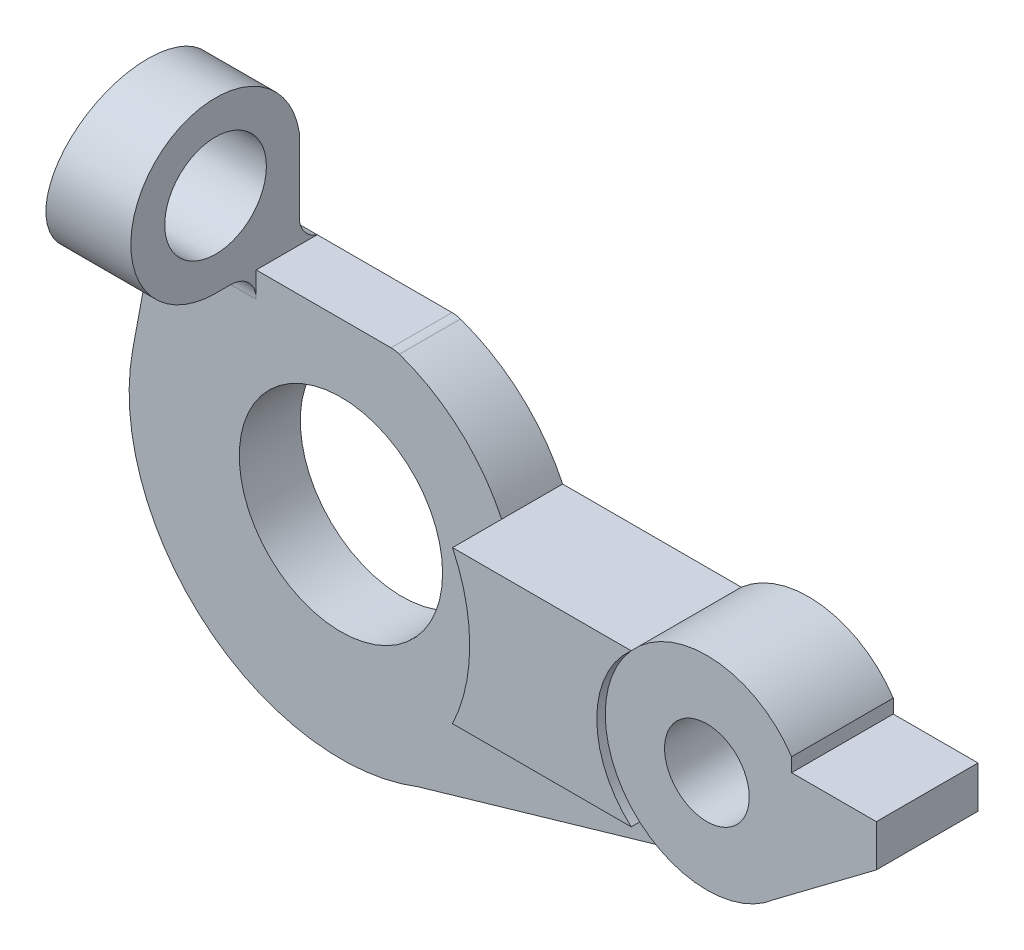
ISO-10303-21;
HEADER;
FILE_DESCRIPTION(('STEP AP214'),'2;1');
FILE_NAME('part.step','',(''),(''),'','','');
FILE_SCHEMA(('AUTOMOTIVE_DESIGN { 1 0 10303 214 1 1 1 1 }'));
ENDSEC;
DATA;
#1=APPLICATION_CONTEXT('core data for automotive mechanical design processes');
#2=APPLICATION_PROTOCOL_DEFINITION('international standard','automotive_design',2000,#1);
#3=PRODUCT_CONTEXT('',#1,'mechanical');
#4=PRODUCT('Part','Part','',(#3));
#5=PRODUCT_RELATED_PRODUCT_CATEGORY('part','',(#4));
#6=PRODUCT_DEFINITION_FORMATION('','',#4);
#7=PRODUCT_DEFINITION_CONTEXT('part definition',#1,'design');
#8=PRODUCT_DEFINITION('design','',#6,#7);
#9=PRODUCT_DEFINITION_SHAPE('','',#8);
#10=(LENGTH_UNIT() NAMED_UNIT(*) SI_UNIT(.MILLI.,.METRE.));
#11=(NAMED_UNIT(*) PLANE_ANGLE_UNIT() SI_UNIT($,.RADIAN.));
#12=(NAMED_UNIT(*) SI_UNIT($,.STERADIAN.) SOLID_ANGLE_UNIT());
#13=UNCERTAINTY_MEASURE_WITH_UNIT(LENGTH_MEASURE(1.E-05),#10,'distance_accuracy_value','');
#14=(GEOMETRIC_REPRESENTATION_CONTEXT(3) GLOBAL_UNCERTAINTY_ASSIGNED_CONTEXT((#13)) GLOBAL_UNIT_ASSIGNED_CONTEXT((#10,
#11,#12)) REPRESENTATION_CONTEXT('',''));
#15=CARTESIAN_POINT('',(0.,0.,0.));
#16=DIRECTION('',(0.,0.,1.));
#17=DIRECTION('',(1.,0.,0.));
#18=AXIS2_PLACEMENT_3D('',#15,#16,#17);
#19=CARTESIAN_POINT('',(25.,0.,10.2));
#20=DIRECTION('',(0.,0.,-1.));
#21=DIRECTION('',(-1.,0.,0.));
#22=AXIS2_PLACEMENT_3D('',#19,#20,#21);
#23=PLANE('',#22);
#24=CARTESIAN_POINT('',(25.,0.,10.2));
#25=DIRECTION('',(0.,0.,-1.));
#26=DIRECTION('',(-1.,0.,0.));
#27=AXIS2_PLACEMENT_3D('',#24,#25,#26);
#28=CIRCLE('',#27,3.);
#29=CARTESIAN_POINT('',(22.,0.,10.2));
#30=VERTEX_POINT('',#29);
#31=EDGE_CURVE('E507',#30,#30,#28,.T.);
#32=ORIENTED_EDGE('',*,*,#31,.T.);
#33=EDGE_LOOP('',(#32));
#34=FACE_BOUND('',#33,.T.);
#35=CARTESIAN_POINT('',(25.,0.,10.2));
#36=DIRECTION('',(0.,0.,-1.));
#37=DIRECTION('',(-1.,0.,0.));
#38=AXIS2_PLACEMENT_3D('',#35,#36,#37);
#39=CIRCLE('',#38,2.97580319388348);
#40=CARTESIAN_POINT('',(22.0241968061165,0.,10.2));
#41=VERTEX_POINT('',#40);
#42=EDGE_CURVE('E512',#41,#41,#39,.T.);
#43=ORIENTED_EDGE('',*,*,#42,.F.);
#44=EDGE_LOOP('',(#43));
#45=FACE_BOUND('',#44,.T.);
#46=ADVANCED_FACE('F34',(#34,#45),#23,.T.);
#47=CARTESIAN_POINT('',(-23.25,20.,2.11988435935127));
#48=DIRECTION('',(0.,-1.,0.));
#49=DIRECTION('',(0.,0.,-1.));
#50=AXIS2_PLACEMENT_3D('',#47,#48,#49);
#51=PLANE('',#50);
#52=DIRECTION('',(0.,0.,-1.));
#53=VECTOR('',#52,1.);
#54=CARTESIAN_POINT('',(-21.7136628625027,20.,2.11988435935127));
#55=LINE('',#54,#53);
#56=CARTESIAN_POINT('',(-21.7136628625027,20.,12.));
#57=VERTEX_POINT('',#56);
#58=CARTESIAN_POINT('',(-21.7136628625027,20.,10.2));
#59=VERTEX_POINT('',#58);
#60=EDGE_CURVE('E492',#57,#59,#55,.T.);
#61=ORIENTED_EDGE('',*,*,#60,.T.);
#62=DIRECTION('',(-1.,0.,0.));
#63=VECTOR('',#62,1.);
#64=CARTESIAN_POINT('',(-10.,20.,10.2));
#65=LINE('',#64,#63);
#66=CARTESIAN_POINT('',(-10.,20.,10.2));
#67=VERTEX_POINT('',#66);
#68=EDGE_CURVE('E57',#59,#67,#65,.F.);
#69=ORIENTED_EDGE('',*,*,#68,.T.);
#70=DIRECTION('',(0.,0.,-1.));
#71=VECTOR('',#70,1.);
#72=CARTESIAN_POINT('',(-10.,20.,2.11988435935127));
#73=LINE('',#72,#71);
#74=CARTESIAN_POINT('',(-10.,20.,12.));
#75=VERTEX_POINT('',#74);
#76=EDGE_CURVE('E486',#75,#67,#73,.T.);
#77=ORIENTED_EDGE('',*,*,#76,.F.);
#78=DIRECTION('',(1.,0.,0.));
#79=VECTOR('',#78,1.);
#80=CARTESIAN_POINT('',(-23.25,20.,12.));
#81=LINE('',#80,#79);
#82=EDGE_CURVE('E480',#57,#75,#81,.T.);
#83=ORIENTED_EDGE('',*,*,#82,.F.);
#84=EDGE_LOOP('',(#61,#69,#77,#83));
#85=FACE_BOUND('',#84,.T.);
#86=ADVANCED_FACE('F209',(#85),#51,.T.);
#87=CARTESIAN_POINT('',(-23.25,30.,12.));
#88=DIRECTION('',(1.,0.,0.));
#89=DIRECTION('',(0.,0.,-1.));
#90=AXIS2_PLACEMENT_3D('',#87,#88,#89);
#91=CYLINDRICAL_SURFACE('',#90,10.);
#92=DIRECTION('',(1.,0.,0.));
#93=VECTOR('',#92,1.);
#94=CARTESIAN_POINT('',(-23.25,31.5437988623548,2.11988435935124));
#95=LINE('',#94,#93);
#96=CARTESIAN_POINT('',(-19.5701740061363,31.5437988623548,2.11988435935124));
#97=VERTEX_POINT('',#96);
#98=CARTESIAN_POINT('',(-10.,31.5437988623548,2.11988435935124));
#99=VERTEX_POINT('',#98);
#100=EDGE_CURVE('E479',#97,#99,#95,.T.);
#101=ORIENTED_EDGE('',*,*,#100,.F.);
#102=CARTESIAN_POINT('',(-19.8568314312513,30.,12.));
#103=DIRECTION('',(-0.983194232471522,0.182562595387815,0.));
#104=DIRECTION('',(0.182562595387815,0.983194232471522,0.));
#105=AXIS2_PLACEMENT_3D('',#102,#103,#104);
#106=ELLIPSE('',#105,10.1709302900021,10.);
#107=EDGE_CURVE('E494',#97,#57,#106,.F.);
#108=ORIENTED_EDGE('',*,*,#107,.T.);
#109=ORIENTED_EDGE('',*,*,#82,.T.);
#110=CARTESIAN_POINT('',(-10.,30.,12.));
#111=DIRECTION('',(1.,0.,0.));
#112=DIRECTION('',(0.,0.,-1.));
#113=AXIS2_PLACEMENT_3D('',#110,#111,#112);
#114=CIRCLE('',#113,10.);
#115=EDGE_CURVE('E489',#99,#75,#114,.T.);
#116=ORIENTED_EDGE('',*,*,#115,.F.);
#117=EDGE_LOOP('',(#101,#108,#109,#116));
#118=FACE_BOUND('',#117,.T.);
#119=ADVANCED_FACE('F214',(#118),#91,.T.);
#120=CARTESIAN_POINT('',(-23.25,31.5437988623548,2.11988435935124));
#121=DIRECTION('',(0.,0.,-1.));
#122=DIRECTION('',(0.,1.,0.));
#123=AXIS2_PLACEMENT_3D('',#120,#121,#122);
#124=PLANE('',#123);
#125=DIRECTION('',(0.,1.,0.));
#126=VECTOR('',#125,1.);
#127=CARTESIAN_POINT('',(-10.,31.5437988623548,2.11988435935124));
#128=LINE('',#127,#126);
#129=CARTESIAN_POINT('',(-10.,22.8679951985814,2.11988435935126));
#130=VERTEX_POINT('',#129);
#131=EDGE_CURVE('E482',#130,#99,#128,.T.);
#132=ORIENTED_EDGE('',*,*,#131,.F.);
#133=DIRECTION('',(1.,0.,0.));
#134=VECTOR('',#133,1.);
#135=CARTESIAN_POINT('',(-21.7136628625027,22.8679951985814,2.11988435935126));
#136=LINE('',#135,#134);
#137=CARTESIAN_POINT('',(-21.1811244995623,22.8679951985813,2.11988435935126));
#138=VERTEX_POINT('',#137);
#139=EDGE_CURVE('E541',#130,#138,#136,.F.);
#140=ORIENTED_EDGE('',*,*,#139,.T.);
#141=DIRECTION('',(0.182562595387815,0.983194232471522,0.));
#142=VECTOR('',#141,1.);
#143=CARTESIAN_POINT('',(-19.692819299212,30.8832903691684,2.11988435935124));
#144=LINE('',#143,#142);
#145=EDGE_CURVE('E527',#138,#97,#144,.T.);
#146=ORIENTED_EDGE('',*,*,#145,.T.);
#147=ORIENTED_EDGE('',*,*,#100,.T.);
#148=EDGE_LOOP('',(#132,#140,#146,#147));
#149=FACE_BOUND('',#148,.T.);
#150=ADVANCED_FACE('F243',(#149),#124,.T.);
#151=CARTESIAN_POINT('',(48.,0.,7.2));
#152=DIRECTION('',(0.,0.,1.));
#153=DIRECTION('',(1.,0.,0.));
#154=AXIS2_PLACEMENT_3D('',#151,#152,#153);
#155=PLANE('',#154);
#156=DIRECTION('',(0.79948094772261,0.600691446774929,0.));
#157=VECTOR('',#156,1.);
#158=CARTESIAN_POINT('',(68.,0.0633659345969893,7.2));
#159=LINE('',#158,#157);
#160=CARTESIAN_POINT('',(55.9372539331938,-9.,7.2));
#161=VERTEX_POINT('',#160);
#162=CARTESIAN_POINT('',(68.,0.0633659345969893,7.2));
#163=VERTEX_POINT('',#162);
#164=EDGE_CURVE('E411',#161,#163,#159,.T.);
#165=ORIENTED_EDGE('',*,*,#164,.F.);
#166=CARTESIAN_POINT('',(48.,0.,7.2));
#167=DIRECTION('',(0.,0.,1.));
#168=DIRECTION('',(1.,0.,0.));
#169=AXIS2_PLACEMENT_3D('',#166,#167,#168);
#170=CIRCLE('',#169,12.);
#171=CARTESIAN_POINT('',(55.230343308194,-9.57716741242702,7.2));
#172=VERTEX_POINT('',#171);
#173=EDGE_CURVE('E402',#172,#161,#170,.T.);
#174=ORIENTED_EDGE('',*,*,#173,.F.);
#175=DIRECTION('',(0.798097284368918,0.602528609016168,0.));
#176=VECTOR('',#175,1.);
#177=CARTESIAN_POINT('',(68.,0.0633659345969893,7.2));
#178=LINE('',#177,#176);
#179=EDGE_CURVE('E388',#172,#163,#178,.T.);
#180=ORIENTED_EDGE('',*,*,#179,.T.);
#181=EDGE_LOOP('',(#165,#174,#180));
#182=FACE_BOUND('',#181,.T.);
#183=ADVANCED_FACE('F245',(#182),#155,.T.);
#184=CARTESIAN_POINT('',(48.,0.,7.2));
#185=DIRECTION('',(0.,0.,-1.));
#186=DIRECTION('',(-1.,0.,0.));
#187=AXIS2_PLACEMENT_3D('',#184,#185,#186);
#188=CYLINDRICAL_SURFACE('',#187,12.);
#189=CARTESIAN_POINT('',(48.,0.,0.));
#190=DIRECTION('',(0.,0.,1.));
#191=DIRECTION('',(1.,0.,0.));
#192=AXIS2_PLACEMENT_3D('',#189,#190,#191);
#193=CIRCLE('',#192,12.);
#194=CARTESIAN_POINT('',(58.,6.63324958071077,0.));
#195=VERTEX_POINT('',#194);
#196=CARTESIAN_POINT('',(40.0627460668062,9.,0.));
#197=VERTEX_POINT('',#196);
#198=EDGE_CURVE('E346',#195,#197,#193,.T.);
#199=ORIENTED_EDGE('',*,*,#198,.T.);
#200=DIRECTION('',(0.,0.,-1.));
#201=VECTOR('',#200,1.);
#202=CARTESIAN_POINT('',(40.0627460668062,9.,7.2));
#203=LINE('',#202,#201);
#204=CARTESIAN_POINT('',(40.0627460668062,9.,12.));
#205=VERTEX_POINT('',#204);
#206=EDGE_CURVE('E340',#205,#197,#203,.T.);
#207=ORIENTED_EDGE('',*,*,#206,.F.);
#208=CARTESIAN_POINT('',(48.,0.,12.));
#209=DIRECTION('',(0.,0.,1.));
#210=DIRECTION('',(1.,0.,0.));
#211=AXIS2_PLACEMENT_3D('',#208,#209,#210);
#212=CIRCLE('',#211,12.);
#213=CARTESIAN_POINT('',(58.,6.63324958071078,12.));
#214=VERTEX_POINT('',#213);
#215=EDGE_CURVE('E438',#214,#205,#212,.T.);
#216=ORIENTED_EDGE('',*,*,#215,.F.);
#217=DIRECTION('',(0.,0.,-1.));
#218=VECTOR('',#217,1.);
#219=CARTESIAN_POINT('',(58.,6.63324958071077,7.2));
#220=LINE('',#219,#218);
#221=EDGE_CURVE('E384',#214,#195,#220,.T.);
#222=ORIENTED_EDGE('',*,*,#221,.T.);
#223=EDGE_LOOP('',(#199,#207,#216,#222));
#224=FACE_BOUND('',#223,.T.);
#225=ADVANCED_FACE('F36',(#224),#188,.T.);
#226=CARTESIAN_POINT('',(18.9736659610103,9.,7.2));
#227=DIRECTION('',(0.,-1.,0.));
#228=DIRECTION('',(0.,0.,-1.));
#229=AXIS2_PLACEMENT_3D('',#226,#227,#228);
#230=PLANE('',#229);
#231=DIRECTION('',(-1.,0.,0.));
#232=VECTOR('',#231,1.);
#233=CARTESIAN_POINT('',(18.9736659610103,9.,0.));
#234=LINE('',#233,#232);
#235=CARTESIAN_POINT('',(18.9736659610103,9.,0.));
#236=VERTEX_POINT('',#235);
#237=EDGE_CURVE('E334',#197,#236,#234,.T.);
#238=ORIENTED_EDGE('',*,*,#237,.T.);
#239=DIRECTION('',(0.,0.,-1.));
#240=VECTOR('',#239,1.);
#241=CARTESIAN_POINT('',(18.9736659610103,9.,7.2));
#242=LINE('',#241,#240);
#243=CARTESIAN_POINT('',(18.9736659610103,9.,7.2));
#244=VERTEX_POINT('',#243);
#245=EDGE_CURVE('E336',#244,#236,#242,.T.);
#246=ORIENTED_EDGE('',*,*,#245,.F.);
#247=DIRECTION('',(0.,0.,-1.));
#248=VECTOR('',#247,1.);
#249=CARTESIAN_POINT('',(18.9736659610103,9.,12.));
#250=LINE('',#249,#248);
#251=CARTESIAN_POINT('',(18.9736659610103,9.,13.));
#252=VERTEX_POINT('',#251);
#253=EDGE_CURVE('E413',#252,#244,#250,.T.);
#254=ORIENTED_EDGE('',*,*,#253,.F.);
#255=DIRECTION('',(-1.,0.,0.));
#256=VECTOR('',#255,1.);
#257=CARTESIAN_POINT('',(18.9736659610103,9.,13.));
#258=LINE('',#257,#256);
#259=CARTESIAN_POINT('',(40.0627460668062,9.,13.));
#260=VERTEX_POINT('',#259);
#261=EDGE_CURVE('E456',#260,#252,#258,.T.);
#262=ORIENTED_EDGE('',*,*,#261,.F.);
#263=DIRECTION('',(0.,0.,-1.));
#264=VECTOR('',#263,1.);
#265=CARTESIAN_POINT('',(40.0627460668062,9.,13.));
#266=LINE('',#265,#264);
#267=EDGE_CURVE('E454',#260,#205,#266,.T.);
#268=ORIENTED_EDGE('',*,*,#267,.T.);
#269=ORIENTED_EDGE('',*,*,#206,.T.);
#270=EDGE_LOOP('',(#238,#246,#254,#262,#268,#269));
#271=FACE_BOUND('',#270,.T.);
#272=ADVANCED_FACE('F324',(#271),#230,.F.);
#273=CARTESIAN_POINT('',(0.,0.,7.2));
#274=DIRECTION('',(0.,0.,-1.));
#275=DIRECTION('',(-1.,0.,0.));
#276=AXIS2_PLACEMENT_3D('',#273,#274,#275);
#277=CYLINDRICAL_SURFACE('',#276,21.);
#278=CARTESIAN_POINT('',(0.,0.,0.));
#279=DIRECTION('',(0.,0.,1.));
#280=DIRECTION('',(1.,0.,0.));
#281=AXIS2_PLACEMENT_3D('',#278,#279,#280);
#282=CIRCLE('',#281,21.);
#283=CARTESIAN_POINT('',(6.90209308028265,19.8333333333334,0.));
#284=VERTEX_POINT('',#283);
#285=EDGE_CURVE('E345',#236,#284,#282,.T.);
#286=ORIENTED_EDGE('',*,*,#285,.T.);
#287=DIRECTION('',(0.,0.,-1.));
#288=VECTOR('',#287,1.);
#289=CARTESIAN_POINT('',(6.90209308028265,19.8333333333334,7.2));
#290=LINE('',#289,#288);
#291=CARTESIAN_POINT('',(6.90209308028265,19.8333333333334,7.2));
#292=VERTEX_POINT('',#291);
#293=EDGE_CURVE('E533',#284,#292,#290,.F.);
#294=ORIENTED_EDGE('',*,*,#293,.T.);
#295=CARTESIAN_POINT('',(0.,0.,7.2));
#296=DIRECTION('',(0.,0.,1.));
#297=DIRECTION('',(1.,0.,0.));
#298=AXIS2_PLACEMENT_3D('',#295,#296,#297);
#299=CIRCLE('',#298,21.);
#300=EDGE_CURVE('E351',#244,#292,#299,.T.);
#301=ORIENTED_EDGE('',*,*,#300,.F.);
#302=ORIENTED_EDGE('',*,*,#245,.T.);
#303=EDGE_LOOP('',(#286,#294,#301,#302));
#304=FACE_BOUND('',#303,.T.);
#305=ADVANCED_FACE('F321',(#304),#277,.T.);
#306=CARTESIAN_POINT('',(-14.9999999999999,20.,7.2));
#307=DIRECTION('',(0.,-1.,0.));
#308=DIRECTION('',(1.,0.,0.));
#309=AXIS2_PLACEMENT_3D('',#306,#307,#308);
#310=PLANE('',#309);
#311=DIRECTION('',(-1.,0.,0.));
#312=VECTOR('',#311,1.);
#313=CARTESIAN_POINT('',(-14.9999999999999,20.,7.2));
#314=LINE('',#313,#312);
#315=CARTESIAN_POINT('',(5.91607978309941,20.0000000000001,7.2));
#316=VERTEX_POINT('',#315);
#317=CARTESIAN_POINT('',(-10.,20.,7.2));
#318=VERTEX_POINT('',#317);
#319=EDGE_CURVE('E379',#316,#318,#314,.T.);
#320=ORIENTED_EDGE('',*,*,#319,.F.);
#321=DIRECTION('',(0.,0.,-1.));
#322=VECTOR('',#321,1.);
#323=CARTESIAN_POINT('',(5.91607978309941,20.0000000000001,7.2));
#324=LINE('',#323,#322);
#325=CARTESIAN_POINT('',(5.91607978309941,20.0000000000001,0.));
#326=VERTEX_POINT('',#325);
#327=EDGE_CURVE('E529',#316,#326,#324,.T.);
#328=ORIENTED_EDGE('',*,*,#327,.T.);
#329=DIRECTION('',(-1.,0.,0.));
#330=VECTOR('',#329,1.);
#331=CARTESIAN_POINT('',(-14.9999999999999,20.,0.));
#332=LINE('',#331,#330);
#333=CARTESIAN_POINT('',(-10.,20.0000000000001,0.));
#334=VERTEX_POINT('',#333);
#335=EDGE_CURVE('E360',#326,#334,#332,.T.);
#336=ORIENTED_EDGE('',*,*,#335,.T.);
#337=EDGE_CURVE('E488',#318,#334,#73,.T.);
#338=ORIENTED_EDGE('',*,*,#337,.F.);
#339=EDGE_LOOP('',(#320,#328,#336,#338));
#340=FACE_BOUND('',#339,.T.);
#341=ADVANCED_FACE('F317',(#340),#310,.F.);
#342=CARTESIAN_POINT('',(0.,0.,7.2));
#343=DIRECTION('',(0.,0.,-1.));
#344=DIRECTION('',(-1.,0.,0.));
#345=AXIS2_PLACEMENT_3D('',#342,#343,#344);
#346=CYLINDRICAL_SURFACE('',#345,25.);
#347=CARTESIAN_POINT('',(0.,0.,7.2));
#348=DIRECTION('',(0.,0.,1.));
#349=DIRECTION('',(1.,0.,0.));
#350=AXIS2_PLACEMENT_3D('',#347,#348,#349);
#351=CIRCLE('',#350,25.);
#352=CARTESIAN_POINT('',(-24.5798558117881,4.56406488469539,7.2));
#353=VERTEX_POINT('',#352);
#354=CARTESIAN_POINT('',(9.07882499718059,-23.2932380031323,7.2));
#355=VERTEX_POINT('',#354);
#356=EDGE_CURVE('E381',#353,#355,#351,.T.);
#357=ORIENTED_EDGE('',*,*,#356,.F.);
#358=DIRECTION('',(0.,0.,1.));
#359=VECTOR('',#358,1.);
#360=CARTESIAN_POINT('',(-24.5798558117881,4.56406488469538,0.));
#361=LINE('',#360,#359);
#362=CARTESIAN_POINT('',(-24.5798558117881,4.56406488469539,0.));
#363=VERTEX_POINT('',#362);
#364=EDGE_CURVE('E496',#363,#353,#361,.T.);
#365=ORIENTED_EDGE('',*,*,#364,.F.);
#366=CARTESIAN_POINT('',(0.,0.,0.));
#367=DIRECTION('',(0.,0.,1.));
#368=DIRECTION('',(1.,0.,0.));
#369=AXIS2_PLACEMENT_3D('',#366,#367,#368);
#370=CIRCLE('',#369,25.);
#371=CARTESIAN_POINT('',(9.07882499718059,-23.2932380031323,0.));
#372=VERTEX_POINT('',#371);
#373=EDGE_CURVE('E364',#363,#372,#370,.T.);
#374=ORIENTED_EDGE('',*,*,#373,.T.);
#375=DIRECTION('',(0.,0.,-1.));
#376=VECTOR('',#375,1.);
#377=CARTESIAN_POINT('',(9.07882499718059,-23.2932380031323,7.2));
#378=LINE('',#377,#376);
#379=EDGE_CURVE('E353',#355,#372,#378,.T.);
#380=ORIENTED_EDGE('',*,*,#379,.F.);
#381=EDGE_LOOP('',(#357,#365,#374,#380));
#382=FACE_BOUND('',#381,.T.);
#383=ADVANCED_FACE('F313',(#382),#346,.T.);
#384=CARTESIAN_POINT('',(9.07882499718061,-23.2932380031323,7.2));
#385=DIRECTION('',(-0.278663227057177,0.96038888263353,0.));
#386=DIRECTION('',(-0.96038888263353,-0.278663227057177,0.));
#387=AXIS2_PLACEMENT_3D('',#384,#385,#386);
#388=PLANE('',#387);
#389=DIRECTION('',(0.96038888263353,0.278663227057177,0.));
#390=VECTOR('',#389,1.);
#391=CARTESIAN_POINT('',(9.07882499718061,-23.2932380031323,0.));
#392=LINE('',#391,#390);
#393=CARTESIAN_POINT('',(48.,-12.,0.));
#394=VERTEX_POINT('',#393);
#395=EDGE_CURVE('E366',#372,#394,#392,.T.);
#396=ORIENTED_EDGE('',*,*,#395,.T.);
#397=DIRECTION('',(0.,0.,-1.));
#398=VECTOR('',#397,1.);
#399=CARTESIAN_POINT('',(48.,-12.,7.2));
#400=LINE('',#399,#398);
#401=CARTESIAN_POINT('',(48.,-12.,7.2));
#402=VERTEX_POINT('',#401);
#403=EDGE_CURVE('E399',#402,#394,#400,.T.);
#404=ORIENTED_EDGE('',*,*,#403,.F.);
#405=DIRECTION('',(0.96038888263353,0.278663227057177,0.));
#406=VECTOR('',#405,1.);
#407=CARTESIAN_POINT('',(9.07882499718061,-23.2932380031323,7.2));
#408=LINE('',#407,#406);
#409=EDGE_CURVE('E383',#355,#402,#408,.T.);
#410=ORIENTED_EDGE('',*,*,#409,.F.);
#411=ORIENTED_EDGE('',*,*,#379,.T.);
#412=EDGE_LOOP('',(#396,#404,#410,#411));
#413=FACE_BOUND('',#412,.T.);
#414=ADVANCED_FACE('F309',(#413),#388,.F.);
#415=CARTESIAN_POINT('',(48.,0.,7.2));
#416=DIRECTION('',(0.,0.,-1.));
#417=DIRECTION('',(-1.,0.,0.));
#418=AXIS2_PLACEMENT_3D('',#415,#416,#417);
#419=CYLINDRICAL_SURFACE('',#418,12.);
#420=CARTESIAN_POINT('',(48.,0.,0.));
#421=DIRECTION('',(0.,0.,1.));
#422=DIRECTION('',(1.,0.,0.));
#423=AXIS2_PLACEMENT_3D('',#420,#421,#422);
#424=CIRCLE('',#423,12.);
#425=CARTESIAN_POINT('',(55.230343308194,-9.57716741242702,0.));
#426=VERTEX_POINT('',#425);
#427=EDGE_CURVE('E368',#394,#426,#424,.T.);
#428=ORIENTED_EDGE('',*,*,#427,.T.);
#429=DIRECTION('',(0.,0.,-1.));
#430=VECTOR('',#429,1.);
#431=CARTESIAN_POINT('',(55.230343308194,-9.57716741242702,7.2));
#432=LINE('',#431,#430);
#433=EDGE_CURVE('E397',#172,#426,#432,.T.);
#434=ORIENTED_EDGE('',*,*,#433,.F.);
#435=ORIENTED_EDGE('',*,*,#173,.T.);
#436=DIRECTION('',(0.,0.,-1.));
#437=VECTOR('',#436,1.);
#438=CARTESIAN_POINT('',(55.9372539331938,-9.,12.));
#439=LINE('',#438,#437);
#440=CARTESIAN_POINT('',(55.9372539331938,-9.,12.));
#441=VERTEX_POINT('',#440);
#442=EDGE_CURVE('E423',#441,#161,#439,.T.);
#443=ORIENTED_EDGE('',*,*,#442,.F.);
#444=CARTESIAN_POINT('',(48.,0.,12.));
#445=DIRECTION('',(0.,0.,1.));
#446=DIRECTION('',(1.,0.,0.));
#447=AXIS2_PLACEMENT_3D('',#444,#445,#446);
#448=CIRCLE('',#447,12.);
#449=CARTESIAN_POINT('',(40.0627460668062,-9.,12.));
#450=VERTEX_POINT('',#449);
#451=EDGE_CURVE('E436',#450,#441,#448,.T.);
#452=ORIENTED_EDGE('',*,*,#451,.F.);
#453=DIRECTION('',(0.,0.,-1.));
#454=VECTOR('',#453,1.);
#455=CARTESIAN_POINT('',(40.0627460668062,-9.,12.));
#456=LINE('',#455,#454);
#457=CARTESIAN_POINT('',(40.0627460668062,-9.,7.2));
#458=VERTEX_POINT('',#457);
#459=EDGE_CURVE('E419',#450,#458,#456,.T.);
#460=ORIENTED_EDGE('',*,*,#459,.T.);
#461=EDGE_CURVE('E408',#458,#402,#170,.T.);
#462=ORIENTED_EDGE('',*,*,#461,.T.);
#463=ORIENTED_EDGE('',*,*,#403,.T.);
#464=EDGE_LOOP('',(#428,#434,#435,#443,#452,#460,#462,#463));
#465=FACE_BOUND('',#464,.T.);
#466=ADVANCED_FACE('F305',(#465),#419,.T.);
#467=CARTESIAN_POINT('',(68.,0.0633659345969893,7.2));
#468=DIRECTION('',(-0.602528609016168,0.798097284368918,0.));
#469=DIRECTION('',(-0.798097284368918,-0.602528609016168,0.));
#470=AXIS2_PLACEMENT_3D('',#467,#468,#469);
#471=PLANE('',#470);
#472=DIRECTION('',(0.798097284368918,0.602528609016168,0.));
#473=VECTOR('',#472,1.);
#474=CARTESIAN_POINT('',(68.,0.0633659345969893,0.));
#475=LINE('',#474,#473);
#476=CARTESIAN_POINT('',(68.,0.0633659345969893,0.));
#477=VERTEX_POINT('',#476);
#478=EDGE_CURVE('E370',#426,#477,#475,.T.);
#479=ORIENTED_EDGE('',*,*,#478,.T.);
#480=DIRECTION('',(0.,0.,-1.));
#481=VECTOR('',#480,1.);
#482=CARTESIAN_POINT('',(68.,0.0633659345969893,7.2));
#483=LINE('',#482,#481);
#484=EDGE_CURVE('E394',#163,#477,#483,.T.);
#485=ORIENTED_EDGE('',*,*,#484,.F.);
#486=ORIENTED_EDGE('',*,*,#179,.F.);
#487=ORIENTED_EDGE('',*,*,#433,.T.);
#488=EDGE_LOOP('',(#479,#485,#486,#487));
#489=FACE_BOUND('',#488,.T.);
#490=ADVANCED_FACE('F301',(#489),#471,.F.);
#491=CARTESIAN_POINT('',(68.,5.,7.2));
#492=DIRECTION('',(-1.,0.,0.));
#493=DIRECTION('',(0.,-1.,0.));
#494=AXIS2_PLACEMENT_3D('',#491,#492,#493);
#495=PLANE('',#494);
#496=DIRECTION('',(0.,1.,0.));
#497=VECTOR('',#496,1.);
#498=CARTESIAN_POINT('',(68.,5.,0.));
#499=LINE('',#498,#497);
#500=CARTESIAN_POINT('',(68.,5.,0.));
#501=VERTEX_POINT('',#500);
#502=EDGE_CURVE('E372',#477,#501,#499,.T.);
#503=ORIENTED_EDGE('',*,*,#502,.T.);
#504=DIRECTION('',(0.,0.,-1.));
#505=VECTOR('',#504,1.);
#506=CARTESIAN_POINT('',(68.,5.,7.2));
#507=LINE('',#506,#505);
#508=CARTESIAN_POINT('',(68.,5.,12.));
#509=VERTEX_POINT('',#508);
#510=EDGE_CURVE('E391',#509,#501,#507,.T.);
#511=ORIENTED_EDGE('',*,*,#510,.F.);
#512=DIRECTION('',(0.,1.,0.));
#513=VECTOR('',#512,1.);
#514=CARTESIAN_POINT('',(68.,0.0633659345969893,12.));
#515=LINE('',#514,#513);
#516=CARTESIAN_POINT('',(68.,0.0633659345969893,12.));
#517=VERTEX_POINT('',#516);
#518=EDGE_CURVE('E431',#517,#509,#515,.T.);
#519=ORIENTED_EDGE('',*,*,#518,.F.);
#520=DIRECTION('',(0.,0.,-1.));
#521=VECTOR('',#520,1.);
#522=CARTESIAN_POINT('',(68.,0.0633659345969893,12.));
#523=LINE('',#522,#521);
#524=EDGE_CURVE('E428',#517,#163,#523,.T.);
#525=ORIENTED_EDGE('',*,*,#524,.T.);
#526=ORIENTED_EDGE('',*,*,#484,.T.);
#527=EDGE_LOOP('',(#503,#511,#519,#525,#526));
#528=FACE_BOUND('',#527,.T.);
#529=ADVANCED_FACE('F297',(#528),#495,.F.);
#530=CARTESIAN_POINT('',(58.,5.,7.2));
#531=DIRECTION('',(0.,-1.,0.));
#532=DIRECTION('',(0.,0.,-1.));
#533=AXIS2_PLACEMENT_3D('',#530,#531,#532);
#534=PLANE('',#533);
#535=DIRECTION('',(-1.,0.,0.));
#536=VECTOR('',#535,1.);
#537=CARTESIAN_POINT('',(58.,5.,0.));
#538=LINE('',#537,#536);
#539=CARTESIAN_POINT('',(58.,5.,0.));
#540=VERTEX_POINT('',#539);
#541=EDGE_CURVE('E374',#501,#540,#538,.T.);
#542=ORIENTED_EDGE('',*,*,#541,.T.);
#543=DIRECTION('',(0.,0.,-1.));
#544=VECTOR('',#543,1.);
#545=CARTESIAN_POINT('',(58.,5.,7.2));
#546=LINE('',#545,#544);
#547=CARTESIAN_POINT('',(58.,5.,12.));
#548=VERTEX_POINT('',#547);
#549=EDGE_CURVE('E387',#548,#540,#546,.T.);
#550=ORIENTED_EDGE('',*,*,#549,.F.);
#551=DIRECTION('',(-1.,0.,0.));
#552=VECTOR('',#551,1.);
#553=CARTESIAN_POINT('',(58.,5.,12.));
#554=LINE('',#553,#552);
#555=EDGE_CURVE('E443',#509,#548,#554,.T.);
#556=ORIENTED_EDGE('',*,*,#555,.F.);
#557=ORIENTED_EDGE('',*,*,#510,.T.);
#558=EDGE_LOOP('',(#542,#550,#556,#557));
#559=FACE_BOUND('',#558,.T.);
#560=ADVANCED_FACE('F293',(#559),#534,.F.);
#561=CARTESIAN_POINT('',(58.,6.63324958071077,7.2));
#562=DIRECTION('',(-1.,0.,0.));
#563=DIRECTION('',(0.,-1.,0.));
#564=AXIS2_PLACEMENT_3D('',#561,#562,#563);
#565=PLANE('',#564);
#566=DIRECTION('',(0.,1.,0.));
#567=VECTOR('',#566,1.);
#568=CARTESIAN_POINT('',(58.,6.63324958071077,0.));
#569=LINE('',#568,#567);
#570=EDGE_CURVE('E376',#540,#195,#569,.T.);
#571=ORIENTED_EDGE('',*,*,#570,.T.);
#572=ORIENTED_EDGE('',*,*,#221,.F.);
#573=DIRECTION('',(0.,1.,0.));
#574=VECTOR('',#573,1.);
#575=CARTESIAN_POINT('',(58.,5.,12.));
#576=LINE('',#575,#574);
#577=EDGE_CURVE('E440',#548,#214,#576,.T.);
#578=ORIENTED_EDGE('',*,*,#577,.F.);
#579=ORIENTED_EDGE('',*,*,#549,.T.);
#580=EDGE_LOOP('',(#571,#572,#578,#579));
#581=FACE_BOUND('',#580,.T.);
#582=ADVANCED_FACE('F289',(#581),#565,.F.);
#583=CARTESIAN_POINT('',(0.,0.,7.2));
#584=DIRECTION('',(0.,0.,1.));
#585=DIRECTION('',(1.,0.,0.));
#586=AXIS2_PLACEMENT_3D('',#583,#584,#585);
#587=CIRCLE('',#586,12.);
#588=CARTESIAN_POINT('',(12.,0.,7.2));
#589=VERTEX_POINT('',#588);
#590=EDGE_CURVE('E469',#589,#589,#587,.T.);
#591=ORIENTED_EDGE('',*,*,#590,.F.);
#592=EDGE_LOOP('',(#591));
#593=FACE_BOUND('',#592,.T.);
#594=ORIENTED_EDGE('',*,*,#300,.T.);
#595=CARTESIAN_POINT('',(5.91607978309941,17.0000000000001,7.2));
#596=DIRECTION('',(0.,0.,1.));
#597=DIRECTION('',(1.,0.,0.));
#598=AXIS2_PLACEMENT_3D('',#595,#596,#597);
#599=CIRCLE('',#598,3.);
#600=EDGE_CURVE('E539',#292,#316,#599,.T.);
#601=ORIENTED_EDGE('',*,*,#600,.T.);
#602=ORIENTED_EDGE('',*,*,#319,.T.);
#603=DIRECTION('',(0.,-1.,0.));
#604=VECTOR('',#603,1.);
#605=CARTESIAN_POINT('',(-10.,30.,7.2));
#606=LINE('',#605,#604);
#607=CARTESIAN_POINT('',(-10.,17.,7.2));
#608=VERTEX_POINT('',#607);
#609=EDGE_CURVE('E49',#318,#608,#606,.T.);
#610=ORIENTED_EDGE('',*,*,#609,.T.);
#611=DIRECTION('',(-1.,0.,0.));
#612=VECTOR('',#611,1.);
#613=CARTESIAN_POINT('',(-21.7136628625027,17.,7.2));
#614=LINE('',#613,#612);
#615=CARTESIAN_POINT('',(-22.2707122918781,17.,7.2));
#616=VERTEX_POINT('',#615);
#617=EDGE_CURVE('E536',#608,#616,#614,.T.);
#618=ORIENTED_EDGE('',*,*,#617,.T.);
#619=DIRECTION('',(-0.182562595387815,-0.983194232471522,0.));
#620=VECTOR('',#619,1.);
#621=CARTESIAN_POINT('',(-21.7136628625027,20.,7.2));
#622=LINE('',#621,#620);
#623=EDGE_CURVE('E502',#616,#353,#622,.T.);
#624=ORIENTED_EDGE('',*,*,#623,.T.);
#625=ORIENTED_EDGE('',*,*,#356,.T.);
#626=ORIENTED_EDGE('',*,*,#409,.T.);
#627=ORIENTED_EDGE('',*,*,#461,.F.);
#628=DIRECTION('',(1.,0.,0.));
#629=VECTOR('',#628,1.);
#630=CARTESIAN_POINT('',(18.9736659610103,-9.,7.2));
#631=LINE('',#630,#629);
#632=CARTESIAN_POINT('',(18.9736659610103,-9.,7.2));
#633=VERTEX_POINT('',#632);
#634=EDGE_CURVE('E412',#633,#458,#631,.T.);
#635=ORIENTED_EDGE('',*,*,#634,.F.);
#636=CARTESIAN_POINT('',(0.,0.,7.2));
#637=DIRECTION('',(0.,0.,-1.));
#638=DIRECTION('',(1.,0.,0.));
#639=AXIS2_PLACEMENT_3D('',#636,#637,#638);
#640=CIRCLE('',#639,21.);
#641=EDGE_CURVE('E449',#244,#633,#640,.T.);
#642=ORIENTED_EDGE('',*,*,#641,.F.);
#643=EDGE_LOOP('',(#594,#601,#602,#610,#618,#624,#625,#626,#627,#635,#642));
#644=FACE_BOUND('',#643,.T.);
#645=ADVANCED_FACE('F285',(#593,#644),#155,.T.);
#646=CARTESIAN_POINT('',(48.,0.,0.));
#647=DIRECTION('',(0.,0.,1.));
#648=DIRECTION('',(1.,0.,0.));
#649=AXIS2_PLACEMENT_3D('',#646,#647,#648);
#650=PLANE('',#649);
#651=CARTESIAN_POINT('',(25.,0.,0.));
#652=DIRECTION('',(0.,0.,-1.));
#653=DIRECTION('',(-1.,0.,0.));
#654=AXIS2_PLACEMENT_3D('',#651,#652,#653);
#655=CIRCLE('',#654,3.);
#656=CARTESIAN_POINT('',(22.,0.,0.));
#657=VERTEX_POINT('',#656);
#658=EDGE_CURVE('E509',#657,#657,#655,.T.);
#659=ORIENTED_EDGE('',*,*,#658,.F.);
#660=EDGE_LOOP('',(#659));
#661=FACE_BOUND('',#660,.T.);
#662=CARTESIAN_POINT('',(48.,0.,0.));
#663=DIRECTION('',(0.,0.,1.));
#664=DIRECTION('',(1.,0.,0.));
#665=AXIS2_PLACEMENT_3D('',#662,#663,#664);
#666=CIRCLE('',#665,5.);
#667=CARTESIAN_POINT('',(53.,0.,0.));
#668=VERTEX_POINT('',#667);
#669=EDGE_CURVE('E473',#668,#668,#666,.T.);
#670=ORIENTED_EDGE('',*,*,#669,.T.);
#671=EDGE_LOOP('',(#670));
#672=FACE_BOUND('',#671,.T.);
#673=CARTESIAN_POINT('',(0.,0.,0.));
#674=DIRECTION('',(0.,0.,1.));
#675=DIRECTION('',(1.,0.,0.));
#676=AXIS2_PLACEMENT_3D('',#673,#674,#675);
#677=CIRCLE('',#676,12.);
#678=CARTESIAN_POINT('',(12.,0.,0.));
#679=VERTEX_POINT('',#678);
#680=EDGE_CURVE('E472',#679,#679,#677,.T.);
#681=ORIENTED_EDGE('',*,*,#680,.T.);
#682=EDGE_LOOP('',(#681));
#683=FACE_BOUND('',#682,.T.);
#684=ORIENTED_EDGE('',*,*,#335,.F.);
#685=CARTESIAN_POINT('',(5.91607978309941,17.0000000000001,0.));
#686=DIRECTION('',(0.,0.,1.));
#687=DIRECTION('',(1.,0.,0.));
#688=AXIS2_PLACEMENT_3D('',#685,#686,#687);
#689=CIRCLE('',#688,3.);
#690=EDGE_CURVE('E356',#326,#284,#689,.F.);
#691=ORIENTED_EDGE('',*,*,#690,.T.);
#692=ORIENTED_EDGE('',*,*,#285,.F.);
#693=ORIENTED_EDGE('',*,*,#237,.F.);
#694=ORIENTED_EDGE('',*,*,#198,.F.);
#695=ORIENTED_EDGE('',*,*,#570,.F.);
#696=ORIENTED_EDGE('',*,*,#541,.F.);
#697=ORIENTED_EDGE('',*,*,#502,.F.);
#698=ORIENTED_EDGE('',*,*,#478,.F.);
#699=ORIENTED_EDGE('',*,*,#427,.F.);
#700=ORIENTED_EDGE('',*,*,#395,.F.);
#701=ORIENTED_EDGE('',*,*,#373,.F.);
#702=DIRECTION('',(-0.182562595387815,-0.983194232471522,0.));
#703=VECTOR('',#702,1.);
#704=CARTESIAN_POINT('',(-21.7136628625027,20.,0.));
#705=LINE('',#704,#703);
#706=CARTESIAN_POINT('',(-21.7136628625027,20.,0.));
#707=VERTEX_POINT('',#706);
#708=EDGE_CURVE('E499',#707,#363,#705,.T.);
#709=ORIENTED_EDGE('',*,*,#708,.F.);
#710=EDGE_CURVE('E357',#334,#707,#332,.T.);
#711=ORIENTED_EDGE('',*,*,#710,.F.);
#712=EDGE_LOOP('',(#684,#691,#692,#693,#694,#695,#696,#697,#698,#699,#700,#701,#709,#711));
#713=FACE_BOUND('',#712,.T.);
#714=ADVANCED_FACE('F281',(#661,#672,#683,#713),#650,.F.);
#715=CARTESIAN_POINT('',(0.,0.,12.));
#716=DIRECTION('',(0.,0.,-1.));
#717=DIRECTION('',(-1.,0.,0.));
#718=AXIS2_PLACEMENT_3D('',#715,#716,#717);
#719=CYLINDRICAL_SURFACE('',#718,21.);
#720=ORIENTED_EDGE('',*,*,#641,.T.);
#721=DIRECTION('',(0.,0.,-1.));
#722=VECTOR('',#721,1.);
#723=CARTESIAN_POINT('',(18.9736659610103,-9.,12.));
#724=LINE('',#723,#722);
#725=CARTESIAN_POINT('',(18.9736659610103,-9.,13.));
#726=VERTEX_POINT('',#725);
#727=EDGE_CURVE('E415',#726,#633,#724,.T.);
#728=ORIENTED_EDGE('',*,*,#727,.F.);
#729=CARTESIAN_POINT('',(0.,0.,13.));
#730=DIRECTION('',(0.,0.,-1.));
#731=DIRECTION('',(1.,0.,0.));
#732=AXIS2_PLACEMENT_3D('',#729,#730,#731);
#733=CIRCLE('',#732,21.);
#734=EDGE_CURVE('E463',#252,#726,#733,.T.);
#735=ORIENTED_EDGE('',*,*,#734,.F.);
#736=ORIENTED_EDGE('',*,*,#253,.T.);
#737=EDGE_LOOP('',(#720,#728,#735,#736));
#738=FACE_BOUND('',#737,.T.);
#739=ADVANCED_FACE('F277',(#738),#719,.F.);
#740=CARTESIAN_POINT('',(18.9736659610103,-9.,12.));
#741=DIRECTION('',(0.,1.,0.));
#742=DIRECTION('',(-1.,0.,0.));
#743=AXIS2_PLACEMENT_3D('',#740,#741,#742);
#744=PLANE('',#743);
#745=ORIENTED_EDGE('',*,*,#634,.T.);
#746=ORIENTED_EDGE('',*,*,#459,.F.);
#747=DIRECTION('',(0.,0.,-1.));
#748=VECTOR('',#747,1.);
#749=CARTESIAN_POINT('',(40.0627460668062,-9.00000000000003,13.));
#750=LINE('',#749,#748);
#751=CARTESIAN_POINT('',(40.0627460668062,-9.00000000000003,13.));
#752=VERTEX_POINT('',#751);
#753=EDGE_CURVE('E451',#752,#450,#750,.T.);
#754=ORIENTED_EDGE('',*,*,#753,.F.);
#755=DIRECTION('',(1.,0.,0.));
#756=VECTOR('',#755,1.);
#757=CARTESIAN_POINT('',(18.9736659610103,-9.,13.));
#758=LINE('',#757,#756);
#759=EDGE_CURVE('E461',#726,#752,#758,.T.);
#760=ORIENTED_EDGE('',*,*,#759,.F.);
#761=ORIENTED_EDGE('',*,*,#727,.T.);
#762=EDGE_LOOP('',(#745,#746,#754,#760,#761));
#763=FACE_BOUND('',#762,.T.);
#764=ADVANCED_FACE('F273',(#763),#744,.F.);
#765=CARTESIAN_POINT('',(68.,0.0633659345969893,12.));
#766=DIRECTION('',(-0.600691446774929,0.79948094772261,0.));
#767=DIRECTION('',(-0.79948094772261,-0.600691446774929,0.));
#768=AXIS2_PLACEMENT_3D('',#765,#766,#767);
#769=PLANE('',#768);
#770=ORIENTED_EDGE('',*,*,#164,.T.);
#771=ORIENTED_EDGE('',*,*,#524,.F.);
#772=DIRECTION('',(0.79948094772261,0.600691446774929,0.));
#773=VECTOR('',#772,1.);
#774=CARTESIAN_POINT('',(68.,0.0633659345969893,12.));
#775=LINE('',#774,#773);
#776=EDGE_CURVE('E434',#441,#517,#775,.T.);
#777=ORIENTED_EDGE('',*,*,#776,.F.);
#778=ORIENTED_EDGE('',*,*,#442,.T.);
#779=EDGE_LOOP('',(#770,#771,#777,#778));
#780=FACE_BOUND('',#779,.T.);
#781=ADVANCED_FACE('F269',(#780),#769,.F.);
#782=CARTESIAN_POINT('',(48.,0.,12.));
#783=DIRECTION('',(0.,0.,1.));
#784=DIRECTION('',(1.,0.,0.));
#785=AXIS2_PLACEMENT_3D('',#782,#783,#784);
#786=PLANE('',#785);
#787=CARTESIAN_POINT('',(48.,0.,12.));
#788=DIRECTION('',(0.,0.,1.));
#789=DIRECTION('',(1.,0.,0.));
#790=AXIS2_PLACEMENT_3D('',#787,#788,#789);
#791=CIRCLE('',#790,5.);
#792=CARTESIAN_POINT('',(53.,0.,12.));
#793=VERTEX_POINT('',#792);
#794=EDGE_CURVE('E476',#793,#793,#791,.T.);
#795=ORIENTED_EDGE('',*,*,#794,.F.);
#796=EDGE_LOOP('',(#795));
#797=FACE_BOUND('',#796,.T.);
#798=CARTESIAN_POINT('',(48.,0.,12.));
#799=DIRECTION('',(0.,0.,-1.));
#800=DIRECTION('',(1.,0.,0.));
#801=AXIS2_PLACEMENT_3D('',#798,#799,#800);
#802=CIRCLE('',#801,12.);
#803=EDGE_CURVE('E466',#450,#205,#802,.T.);
#804=ORIENTED_EDGE('',*,*,#803,.F.);
#805=ORIENTED_EDGE('',*,*,#451,.T.);
#806=ORIENTED_EDGE('',*,*,#776,.T.);
#807=ORIENTED_EDGE('',*,*,#518,.T.);
#808=ORIENTED_EDGE('',*,*,#555,.T.);
#809=ORIENTED_EDGE('',*,*,#577,.T.);
#810=ORIENTED_EDGE('',*,*,#215,.T.);
#811=EDGE_LOOP('',(#804,#805,#806,#807,#808,#809,#810));
#812=FACE_BOUND('',#811,.T.);
#813=ADVANCED_FACE('F265',(#797,#812),#786,.T.);
#814=CARTESIAN_POINT('',(48.,0.,13.));
#815=DIRECTION('',(0.,0.,-1.));
#816=DIRECTION('',(-1.,0.,0.));
#817=AXIS2_PLACEMENT_3D('',#814,#815,#816);
#818=CYLINDRICAL_SURFACE('',#817,12.);
#819=ORIENTED_EDGE('',*,*,#803,.T.);
#820=ORIENTED_EDGE('',*,*,#267,.F.);
#821=CARTESIAN_POINT('',(48.,0.,13.));
#822=DIRECTION('',(0.,0.,-1.));
#823=DIRECTION('',(1.,0.,0.));
#824=AXIS2_PLACEMENT_3D('',#821,#822,#823);
#825=CIRCLE('',#824,12.);
#826=EDGE_CURVE('E459',#752,#260,#825,.T.);
#827=ORIENTED_EDGE('',*,*,#826,.F.);
#828=ORIENTED_EDGE('',*,*,#753,.T.);
#829=EDGE_LOOP('',(#819,#820,#827,#828));
#830=FACE_BOUND('',#829,.T.);
#831=ADVANCED_FACE('F261',(#830),#818,.F.);
#832=CARTESIAN_POINT('',(0.,0.,13.));
#833=DIRECTION('',(0.,0.,1.));
#834=DIRECTION('',(1.,0.,0.));
#835=AXIS2_PLACEMENT_3D('',#832,#833,#834);
#836=PLANE('',#835);
#837=ORIENTED_EDGE('',*,*,#734,.T.);
#838=ORIENTED_EDGE('',*,*,#759,.T.);
#839=ORIENTED_EDGE('',*,*,#826,.T.);
#840=ORIENTED_EDGE('',*,*,#261,.T.);
#841=EDGE_LOOP('',(#837,#838,#839,#840));
#842=FACE_BOUND('',#841,.T.);
#843=ADVANCED_FACE('F257',(#842),#836,.T.);
#844=CARTESIAN_POINT('',(0.,0.,-2.49999999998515E-05));
#845=DIRECTION('',(0.,0.,1.));
#846=DIRECTION('',(1.,0.,0.));
#847=AXIS2_PLACEMENT_3D('',#844,#845,#846);
#848=CYLINDRICAL_SURFACE('',#847,12.);
#849=CARTESIAN_POINT('',(12.,0.,7.2));
#850=CARTESIAN_POINT('',(12.,0.,7.125));
#851=CARTESIAN_POINT('',(12.,0.,7.05));
#852=CARTESIAN_POINT('',(12.,0.,6.9));
#853=CARTESIAN_POINT('',(12.,0.,6.825));
#854=CARTESIAN_POINT('',(12.,0.,6.675));
#855=CARTESIAN_POINT('',(12.,0.,6.6));
#856=CARTESIAN_POINT('',(12.,0.,6.45));
#857=CARTESIAN_POINT('',(12.,0.,6.375));
#858=CARTESIAN_POINT('',(12.,0.,6.225));
#859=CARTESIAN_POINT('',(12.,0.,6.15));
#860=CARTESIAN_POINT('',(12.,0.,6.));
#861=CARTESIAN_POINT('',(12.,0.,5.925));
#862=CARTESIAN_POINT('',(12.,0.,5.775));
#863=CARTESIAN_POINT('',(12.,0.,5.7));
#864=CARTESIAN_POINT('',(12.,0.,5.55));
#865=CARTESIAN_POINT('',(12.,0.,5.475));
#866=CARTESIAN_POINT('',(12.,0.,5.325));
#867=CARTESIAN_POINT('',(12.,0.,5.25));
#868=CARTESIAN_POINT('',(12.,0.,5.1));
#869=CARTESIAN_POINT('',(12.,0.,5.025));
#870=CARTESIAN_POINT('',(12.,0.,4.875));
#871=CARTESIAN_POINT('',(12.,0.,4.8));
#872=CARTESIAN_POINT('',(12.,0.,4.65));
#873=CARTESIAN_POINT('',(12.,0.,4.575));
#874=CARTESIAN_POINT('',(12.,0.,4.425));
#875=CARTESIAN_POINT('',(12.,0.,4.35));
#876=CARTESIAN_POINT('',(12.,0.,4.2));
#877=CARTESIAN_POINT('',(12.,0.,4.125));
#878=CARTESIAN_POINT('',(12.,0.,3.975));
#879=CARTESIAN_POINT('',(12.,0.,3.9));
#880=CARTESIAN_POINT('',(12.,0.,3.75));
#881=CARTESIAN_POINT('',(12.,0.,3.675));
#882=CARTESIAN_POINT('',(12.,0.,3.525));
#883=CARTESIAN_POINT('',(12.,0.,3.45));
#884=CARTESIAN_POINT('',(12.,0.,3.3));
#885=CARTESIAN_POINT('',(12.,0.,3.225));
#886=CARTESIAN_POINT('',(12.,0.,3.075));
#887=CARTESIAN_POINT('',(12.,0.,3.));
#888=CARTESIAN_POINT('',(12.,0.,2.85));
#889=CARTESIAN_POINT('',(12.,0.,2.775));
#890=CARTESIAN_POINT('',(12.,0.,2.625));
#891=CARTESIAN_POINT('',(12.,0.,2.55));
#892=CARTESIAN_POINT('',(12.,0.,2.4));
#893=CARTESIAN_POINT('',(12.,0.,2.325));
#894=CARTESIAN_POINT('',(12.,0.,2.175));
#895=CARTESIAN_POINT('',(12.,0.,2.1));
#896=CARTESIAN_POINT('',(12.,0.,1.95));
#897=CARTESIAN_POINT('',(12.,0.,1.875));
#898=CARTESIAN_POINT('',(12.,0.,1.725));
#899=CARTESIAN_POINT('',(12.,0.,1.65));
#900=CARTESIAN_POINT('',(12.,0.,1.5));
#901=CARTESIAN_POINT('',(12.,0.,1.425));
#902=CARTESIAN_POINT('',(12.,0.,1.275));
#903=CARTESIAN_POINT('',(12.,0.,1.2));
#904=CARTESIAN_POINT('',(12.,0.,1.05));
#905=CARTESIAN_POINT('',(12.,0.,0.975));
#906=CARTESIAN_POINT('',(12.,0.,0.825));
#907=CARTESIAN_POINT('',(12.,0.,0.75));
#908=CARTESIAN_POINT('',(12.,0.,0.6));
#909=CARTESIAN_POINT('',(12.,0.,0.525));
#910=CARTESIAN_POINT('',(12.,0.,0.375));
#911=CARTESIAN_POINT('',(12.,0.,0.3));
#912=CARTESIAN_POINT('',(12.,0.,0.15));
#913=CARTESIAN_POINT('',(12.,0.,0.0750000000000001));
#914=CARTESIAN_POINT('',(12.,0.,0.));
#915=B_SPLINE_CURVE_WITH_KNOTS('',3,(#849,#850,#851,#852,#853,#854,#855,#856,#857,#858,#859,
#860,#861,#862,#863,#864,#865,#866,#867,#868,#869,#870,#871,#872,#873,#874,#875,#876,#877,#878,
#879,#880,#881,#882,#883,#884,#885,#886,#887,#888,#889,#890,#891,#892,#893,#894,#895,#896,#897,
#898,#899,#900,#901,#902,#903,#904,#905,#906,#907,#908,#909,#910,#911,#912,#913,#914),
.UNSPECIFIED.,.F.,.F.,(4,2,2,2,2,2,2,2,2,2,2,2,2,2,2,2,2,2,2,2,2,2,2,2,2,2,2,2,2,2,2,2,4),(0.,
0.225,0.45,0.675,0.9,1.125,1.35,1.575,1.8,2.025,2.25,2.475,2.7,2.925,3.15,3.375,3.6,3.825,4.05,
4.275,4.5,4.725,4.95,5.175,5.4,5.625,5.85,6.075,6.3,6.525,6.75,6.975,7.2),.UNSPECIFIED.);
#916=EDGE_CURVE('BSEAM253',#589,#679,#915,.T.);
#917=ORIENTED_EDGE('',*,*,#590,.T.);
#918=ORIENTED_EDGE('',*,*,#680,.F.);
#919=ORIENTED_EDGE('',*,*,#916,.T.);
#920=ORIENTED_EDGE('',*,*,#916,.F.);
#921=EDGE_LOOP('',(#917,#919,#918,#920));
#922=FACE_BOUND('',#921,.T.);
#923=ADVANCED_FACE('F253',(#922),#848,.F.);
#924=CARTESIAN_POINT('',(48.,0.,-2.50000000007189E-05));
#925=DIRECTION('',(0.,0.,1.));
#926=DIRECTION('',(1.,0.,0.));
#927=AXIS2_PLACEMENT_3D('',#924,#925,#926);
#928=CYLINDRICAL_SURFACE('',#927,5.);
#929=ORIENTED_EDGE('',*,*,#794,.T.);
#930=EDGE_LOOP('',(#929));
#931=FACE_BOUND('',#930,.T.);
#932=ORIENTED_EDGE('',*,*,#669,.F.);
#933=EDGE_LOOP('',(#932));
#934=FACE_BOUND('',#933,.T.);
#935=ADVANCED_FACE('F241',(#931,#934),#928,.F.);
#936=CARTESIAN_POINT('',(-10.,30.,12.));
#937=DIRECTION('',(1.,0.,0.));
#938=DIRECTION('',(0.,0.,-1.));
#939=AXIS2_PLACEMENT_3D('',#936,#937,#938);
#940=PLANE('',#939);
#941=CARTESIAN_POINT('',(-10.,30.,12.));
#942=DIRECTION('',(1.,0.,0.));
#943=DIRECTION('',(0.,0.,-1.));
#944=AXIS2_PLACEMENT_3D('',#941,#942,#943);
#945=CIRCLE('',#944,6.);
#946=CARTESIAN_POINT('',(-10.,30.,6.));
#947=VERTEX_POINT('',#946);
#948=EDGE_CURVE('E504',#947,#947,#945,.T.);
#949=ORIENTED_EDGE('',*,*,#948,.F.);
#950=EDGE_LOOP('',(#949));
#951=FACE_BOUND('',#950,.T.);
#952=ORIENTED_EDGE('',*,*,#115,.T.);
#953=ORIENTED_EDGE('',*,*,#76,.T.);
#954=CARTESIAN_POINT('',(-10.,17.,10.2));
#955=DIRECTION('',(1.,0.,0.));
#956=DIRECTION('',(0.,0.,-1.));
#957=AXIS2_PLACEMENT_3D('',#954,#955,#956);
#958=CIRCLE('',#957,3.);
#959=EDGE_CURVE('E11',#67,#608,#958,.F.);
#960=ORIENTED_EDGE('',*,*,#959,.T.);
#961=ORIENTED_EDGE('',*,*,#609,.F.);
#962=ORIENTED_EDGE('',*,*,#337,.T.);
#963=CARTESIAN_POINT('',(-10.,22.8679951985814,-0.880115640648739));
#964=DIRECTION('',(1.,0.,0.));
#965=DIRECTION('',(0.,0.,-1.));
#966=AXIS2_PLACEMENT_3D('',#963,#964,#965);
#967=CIRCLE('',#966,3.);
#968=EDGE_CURVE('E544',#334,#130,#967,.F.);
#969=ORIENTED_EDGE('',*,*,#968,.T.);
#970=ORIENTED_EDGE('',*,*,#131,.T.);
#971=EDGE_LOOP('',(#952,#953,#960,#961,#962,#969,#970));
#972=FACE_BOUND('',#971,.T.);
#973=ADVANCED_FACE('F237',(#951,#972),#940,.T.);
#974=CARTESIAN_POINT('',(-18.,40.,22.));
#975=DIRECTION('',(-0.983194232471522,0.182562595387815,0.));
#976=DIRECTION('',(-0.182562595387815,-0.983194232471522,0.));
#977=AXIS2_PLACEMENT_3D('',#974,#975,#976);
#978=PLANE('',#977);
#979=CARTESIAN_POINT('',(-19.8568314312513,30.,12.));
#980=DIRECTION('',(-0.983194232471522,0.182562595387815,0.));
#981=DIRECTION('',(0.182562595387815,0.983194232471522,0.));
#982=AXIS2_PLACEMENT_3D('',#979,#980,#981);
#983=ELLIPSE('',#982,6.10255817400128,6.);
#984=CARTESIAN_POINT('',(-18.7427325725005,36.,12.));
#985=VERTEX_POINT('',#984);
#986=EDGE_CURVE('E38',#985,#985,#983,.T.);
#987=ORIENTED_EDGE('',*,*,#986,.F.);
#988=EDGE_LOOP('',(#987));
#989=FACE_BOUND('',#988,.T.);
#990=ORIENTED_EDGE('',*,*,#107,.F.);
#991=ORIENTED_EDGE('',*,*,#145,.F.);
#992=CARTESIAN_POINT('',(-21.1811244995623,22.8679951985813,-0.880115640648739));
#993=DIRECTION('',(-0.983194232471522,0.182562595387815,0.));
#994=DIRECTION('',(-0.182562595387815,-0.983194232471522,0.));
#995=AXIS2_PLACEMENT_3D('',#992,#993,#994);
#996=ELLIPSE('',#995,3.05127908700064,3.);
#997=EDGE_CURVE('E546',#138,#707,#996,.F.);
#998=ORIENTED_EDGE('',*,*,#997,.T.);
#999=ORIENTED_EDGE('',*,*,#708,.T.);
#1000=ORIENTED_EDGE('',*,*,#364,.T.);
#1001=ORIENTED_EDGE('',*,*,#623,.F.);
#1002=CARTESIAN_POINT('',(-22.2707122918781,17.,10.2));
#1003=DIRECTION('',(-0.983194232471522,0.182562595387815,0.));
#1004=DIRECTION('',(0.182562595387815,0.983194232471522,0.));
#1005=AXIS2_PLACEMENT_3D('',#1002,#1003,#1004);
#1006=ELLIPSE('',#1005,3.05127908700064,3.);
#1007=EDGE_CURVE('E43',#616,#59,#1006,.F.);
#1008=ORIENTED_EDGE('',*,*,#1007,.T.);
#1009=ORIENTED_EDGE('',*,*,#60,.F.);
#1010=EDGE_LOOP('',(#990,#991,#998,#999,#1000,#1001,#1008,#1009));
#1011=FACE_BOUND('',#1010,.T.);
#1012=ADVANCED_FACE('F233',(#989,#1011),#978,.T.);
#1013=CARTESIAN_POINT('',(5.91607978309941,17.0000000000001,7.2));
#1014=DIRECTION('',(0.,0.,-1.));
#1015=DIRECTION('',(-1.,0.,0.));
#1016=AXIS2_PLACEMENT_3D('',#1013,#1014,#1015);
#1017=CYLINDRICAL_SURFACE('',#1016,3.);
#1018=ORIENTED_EDGE('',*,*,#600,.F.);
#1019=ORIENTED_EDGE('',*,*,#293,.F.);
#1020=ORIENTED_EDGE('',*,*,#690,.F.);
#1021=ORIENTED_EDGE('',*,*,#327,.F.);
#1022=EDGE_LOOP('',(#1018,#1019,#1020,#1021));
#1023=FACE_BOUND('',#1022,.T.);
#1024=ADVANCED_FACE('F229',(#1023),#1017,.T.);
#1025=CARTESIAN_POINT('',(-14.9999999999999,22.8679951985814,-0.880115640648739));
#1026=DIRECTION('',(-1.,0.,0.));
#1027=DIRECTION('',(0.,-1.,0.));
#1028=AXIS2_PLACEMENT_3D('',#1025,#1026,#1027);
#1029=CYLINDRICAL_SURFACE('',#1028,3.);
#1030=ORIENTED_EDGE('',*,*,#997,.F.);
#1031=ORIENTED_EDGE('',*,*,#139,.F.);
#1032=ORIENTED_EDGE('',*,*,#968,.F.);
#1033=ORIENTED_EDGE('',*,*,#710,.T.);
#1034=EDGE_LOOP('',(#1030,#1031,#1032,#1033));
#1035=FACE_BOUND('',#1034,.T.);
#1036=ADVANCED_FACE('F225',(#1035),#1029,.F.);
#1037=CARTESIAN_POINT('',(48.,17.,10.2));
#1038=DIRECTION('',(1.,0.,0.));
#1039=DIRECTION('',(0.,0.,-1.));
#1040=AXIS2_PLACEMENT_3D('',#1037,#1038,#1039);
#1041=CYLINDRICAL_SURFACE('',#1040,3.);
#1042=ORIENTED_EDGE('',*,*,#959,.F.);
#1043=ORIENTED_EDGE('',*,*,#68,.F.);
#1044=ORIENTED_EDGE('',*,*,#1007,.F.);
#1045=ORIENTED_EDGE('',*,*,#617,.F.);
#1046=EDGE_LOOP('',(#1042,#1043,#1044,#1045));
#1047=FACE_BOUND('',#1046,.T.);
#1048=ADVANCED_FACE('F221',(#1047),#1041,.F.);
#1049=CARTESIAN_POINT('',(-25.,30.,12.));
#1050=DIRECTION('',(1.,0.,0.));
#1051=DIRECTION('',(0.,0.,-1.));
#1052=AXIS2_PLACEMENT_3D('',#1049,#1050,#1051);
#1053=CYLINDRICAL_SURFACE('',#1052,6.);
#1054=ORIENTED_EDGE('',*,*,#986,.T.);
#1055=EDGE_LOOP('',(#1054));
#1056=FACE_BOUND('',#1055,.T.);
#1057=ORIENTED_EDGE('',*,*,#948,.T.);
#1058=EDGE_LOOP('',(#1057));
#1059=FACE_BOUND('',#1058,.T.);
#1060=ADVANCED_FACE('F203',(#1056,#1059),#1053,.F.);
#1061=CARTESIAN_POINT('',(25.,0.,10.2));
#1062=DIRECTION('',(0.,0.,-1.));
#1063=DIRECTION('',(-1.,0.,0.));
#1064=AXIS2_PLACEMENT_3D('',#1061,#1062,#1063);
#1065=CYLINDRICAL_SURFACE('',#1064,3.);
#1066=ORIENTED_EDGE('',*,*,#31,.F.);
#1067=EDGE_LOOP('',(#1066));
#1068=FACE_BOUND('',#1067,.T.);
#1069=ORIENTED_EDGE('',*,*,#658,.T.);
#1070=EDGE_LOOP('',(#1069));
#1071=FACE_BOUND('',#1070,.T.);
#1072=ADVANCED_FACE('F197',(#1068,#1071),#1065,.F.);
#1073=CARTESIAN_POINT('',(25.,0.,12.6969953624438));
#1074=DIRECTION('',(0.,0.,-1.));
#1075=DIRECTION('',(-1.,0.,0.));
#1076=AXIS2_PLACEMENT_3D('',#1073,#1074,#1075);
#1077=CONICAL_SURFACE('',#1076,0.,0.872664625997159);
#1078=ORIENTED_EDGE('',*,*,#42,.T.);
#1079=EDGE_LOOP('',(#1078));
#1080=FACE_BOUND('',#1079,.T.);
#1081=CARTESIAN_POINT('',(25.,0.,12.6969953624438));
#1082=VERTEX_POINT('',#1081);
#1083=VERTEX_LOOP('',#1082);
#1084=FACE_BOUND('',#1083,.T.);
#1085=ADVANCED_FACE('F195',(#1080,#1084),#1077,.F.);
#1086=CLOSED_SHELL('',(#46,#86,#119,#150,#183,#225,#272,#305,#341,#383,#414,#466,#490,#529,#560,
#582,#645,#714,#739,#764,#781,#813,#831,#843,#923,#935,#973,#1012,#1024,#1036,#1048,#1060,#1072,#1085));
#1087=MANIFOLD_SOLID_BREP('B2',#1086);
#1088=ADVANCED_BREP_SHAPE_REPRESENTATION('',(#18,#1087),#14);
#1089=SHAPE_DEFINITION_REPRESENTATION(#9,#1088);
ENDSEC;
END-ISO-10303-21;
